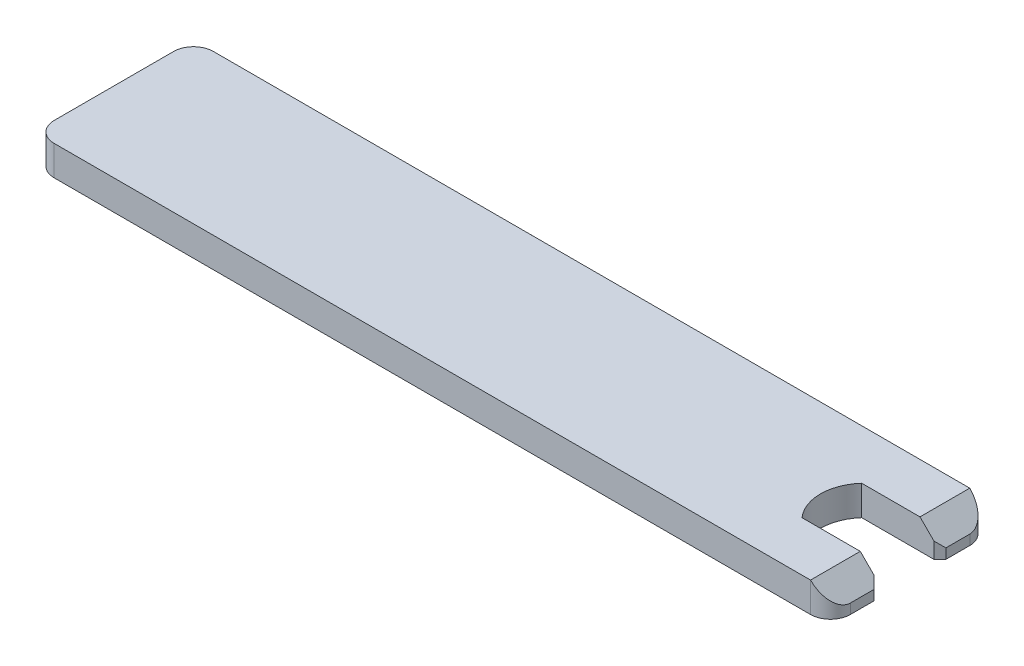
ISO-10303-21;
HEADER;
FILE_DESCRIPTION(('STEP AP214'),'2;1');
FILE_NAME('part.step','',(''),(''),'','','');
FILE_SCHEMA(('AUTOMOTIVE_DESIGN { 1 0 10303 214 1 1 1 1 }'));
ENDSEC;
DATA;
#1=APPLICATION_CONTEXT('core data for automotive mechanical design processes');
#2=APPLICATION_PROTOCOL_DEFINITION('international standard','automotive_design',2000,#1);
#3=PRODUCT_CONTEXT('',#1,'mechanical');
#4=PRODUCT('Part','Part','',(#3));
#5=PRODUCT_RELATED_PRODUCT_CATEGORY('part','',(#4));
#6=PRODUCT_DEFINITION_FORMATION('','',#4);
#7=PRODUCT_DEFINITION_CONTEXT('part definition',#1,'design');
#8=PRODUCT_DEFINITION('design','',#6,#7);
#9=PRODUCT_DEFINITION_SHAPE('','',#8);
#10=(LENGTH_UNIT() NAMED_UNIT(*) SI_UNIT(.MILLI.,.METRE.));
#11=(NAMED_UNIT(*) PLANE_ANGLE_UNIT() SI_UNIT($,.RADIAN.));
#12=(NAMED_UNIT(*) SI_UNIT($,.STERADIAN.) SOLID_ANGLE_UNIT());
#13=UNCERTAINTY_MEASURE_WITH_UNIT(LENGTH_MEASURE(1.E-05),#10,'distance_accuracy_value','');
#14=(GEOMETRIC_REPRESENTATION_CONTEXT(3) GLOBAL_UNCERTAINTY_ASSIGNED_CONTEXT((#13)) GLOBAL_UNIT_ASSIGNED_CONTEXT((#10,
#11,#12)) REPRESENTATION_CONTEXT('',''));
#15=CARTESIAN_POINT('',(0.,0.,0.));
#16=DIRECTION('',(0.,0.,1.));
#17=DIRECTION('',(1.,0.,0.));
#18=AXIS2_PLACEMENT_3D('',#15,#16,#17);
#19=CARTESIAN_POINT('',(2.25,0.75,-1.5));
#20=DIRECTION('',(-1.,0.,0.));
#21=DIRECTION('',(0.,0.,1.));
#22=AXIS2_PLACEMENT_3D('',#19,#20,#21);
#23=PLANE('',#22);
#24=DIRECTION('',(0.,0.,1.));
#25=VECTOR('',#24,1.);
#26=CARTESIAN_POINT('',(2.25,-0.250000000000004,-1.5));
#27=LINE('',#26,#25);
#28=CARTESIAN_POINT('',(2.25,-0.250000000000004,-2.99999999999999));
#29=VERTEX_POINT('',#28);
#30=CARTESIAN_POINT('',(2.25,-0.250000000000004,-1.8));
#31=VERTEX_POINT('',#30);
#32=EDGE_CURVE('E199',#29,#31,#27,.T.);
#33=ORIENTED_EDGE('',*,*,#32,.T.);
#34=DIRECTION('',(0.,-1.,0.));
#35=VECTOR('',#34,1.);
#36=CARTESIAN_POINT('',(2.25,0.75,-1.8));
#37=LINE('',#36,#35);
#38=CARTESIAN_POINT('',(2.25,-0.75,-1.8));
#39=VERTEX_POINT('',#38);
#40=EDGE_CURVE('E246',#31,#39,#37,.T.);
#41=ORIENTED_EDGE('',*,*,#40,.T.);
#42=DIRECTION('',(0.,0.,-1.));
#43=VECTOR('',#42,1.);
#44=CARTESIAN_POINT('',(2.25,-0.75,-1.5));
#45=LINE('',#44,#43);
#46=CARTESIAN_POINT('',(2.25,-0.75,-2.99999999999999));
#47=VERTEX_POINT('',#46);
#48=EDGE_CURVE('E174',#39,#47,#45,.T.);
#49=ORIENTED_EDGE('',*,*,#48,.T.);
#50=DIRECTION('',(0.,-1.,0.));
#51=VECTOR('',#50,1.);
#52=CARTESIAN_POINT('',(2.25,0.75,-2.99999999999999));
#53=LINE('',#52,#51);
#54=EDGE_CURVE('E222',#47,#29,#53,.F.);
#55=ORIENTED_EDGE('',*,*,#54,.T.);
#56=EDGE_LOOP('',(#33,#41,#49,#55));
#57=FACE_BOUND('',#56,.T.);
#58=ADVANCED_FACE('F37',(#57),#23,.F.);
#59=CARTESIAN_POINT('',(2.25,0.75,-3.99999999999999));
#60=DIRECTION('',(0.,0.,1.));
#61=DIRECTION('',(1.,0.,0.));
#62=AXIS2_PLACEMENT_3D('',#59,#60,#61);
#63=PLANE('',#62);
#64=DIRECTION('',(-1.,0.,0.));
#65=VECTOR('',#64,1.);
#66=CARTESIAN_POINT('',(2.25,0.75,-3.99999999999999));
#67=LINE('',#66,#65);
#68=CARTESIAN_POINT('',(1.25,0.75,-3.99999999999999));
#69=VERTEX_POINT('',#68);
#70=CARTESIAN_POINT('',(-36.75,0.75,-4.));
#71=VERTEX_POINT('',#70);
#72=EDGE_CURVE('E193',#69,#71,#67,.T.);
#73=ORIENTED_EDGE('',*,*,#72,.F.);
#74=DIRECTION('',(0.,-1.,0.));
#75=VECTOR('',#74,1.);
#76=CARTESIAN_POINT('',(1.25,0.75,-3.99999999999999));
#77=LINE('',#76,#75);
#78=CARTESIAN_POINT('',(1.25,-0.75,-3.99999999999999));
#79=VERTEX_POINT('',#78);
#80=EDGE_CURVE('E210',#69,#79,#77,.T.);
#81=ORIENTED_EDGE('',*,*,#80,.T.);
#82=DIRECTION('',(-1.,0.,0.));
#83=VECTOR('',#82,1.);
#84=CARTESIAN_POINT('',(2.25,-0.75,-3.99999999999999));
#85=LINE('',#84,#83);
#86=CARTESIAN_POINT('',(-36.75,-0.75,-4.));
#87=VERTEX_POINT('',#86);
#88=EDGE_CURVE('E176',#79,#87,#85,.T.);
#89=ORIENTED_EDGE('',*,*,#88,.T.);
#90=DIRECTION('',(0.,-1.,0.));
#91=VECTOR('',#90,1.);
#92=CARTESIAN_POINT('',(-36.75,0.75,-4.));
#93=LINE('',#92,#91);
#94=EDGE_CURVE('E208',#87,#71,#93,.F.);
#95=ORIENTED_EDGE('',*,*,#94,.T.);
#96=EDGE_LOOP('',(#73,#81,#89,#95));
#97=FACE_BOUND('',#96,.T.);
#98=ADVANCED_FACE('F282',(#97),#63,.F.);
#99=CARTESIAN_POINT('',(-37.75,0.75,-4.));
#100=DIRECTION('',(1.,0.,0.));
#101=DIRECTION('',(0.,0.,-1.));
#102=AXIS2_PLACEMENT_3D('',#99,#100,#101);
#103=PLANE('',#102);
#104=DIRECTION('',(0.,0.,1.));
#105=VECTOR('',#104,1.);
#106=CARTESIAN_POINT('',(-37.75,0.75,-4.));
#107=LINE('',#106,#105);
#108=CARTESIAN_POINT('',(-37.75,0.75,-3.));
#109=VERTEX_POINT('',#108);
#110=CARTESIAN_POINT('',(-37.75,0.75,3.));
#111=VERTEX_POINT('',#110);
#112=EDGE_CURVE('E294',#109,#111,#107,.T.);
#113=ORIENTED_EDGE('',*,*,#112,.F.);
#114=DIRECTION('',(0.,-1.,0.));
#115=VECTOR('',#114,1.);
#116=CARTESIAN_POINT('',(-37.75,0.75,-3.));
#117=LINE('',#116,#115);
#118=CARTESIAN_POINT('',(-37.75,-0.75,-3.));
#119=VERTEX_POINT('',#118);
#120=EDGE_CURVE('E239',#109,#119,#117,.T.);
#121=ORIENTED_EDGE('',*,*,#120,.T.);
#122=DIRECTION('',(0.,0.,1.));
#123=VECTOR('',#122,1.);
#124=CARTESIAN_POINT('',(-37.75,-0.75,-4.));
#125=LINE('',#124,#123);
#126=CARTESIAN_POINT('',(-37.75,-0.75,3.));
#127=VERTEX_POINT('',#126);
#128=EDGE_CURVE('E179',#119,#127,#125,.T.);
#129=ORIENTED_EDGE('',*,*,#128,.T.);
#130=DIRECTION('',(0.,-1.,0.));
#131=VECTOR('',#130,1.);
#132=CARTESIAN_POINT('',(-37.75,0.75,3.));
#133=LINE('',#132,#131);
#134=EDGE_CURVE('E237',#127,#111,#133,.F.);
#135=ORIENTED_EDGE('',*,*,#134,.T.);
#136=EDGE_LOOP('',(#113,#121,#129,#135));
#137=FACE_BOUND('',#136,.T.);
#138=ADVANCED_FACE('F291',(#137),#103,.F.);
#139=CARTESIAN_POINT('',(2.25,0.75,3.99999999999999));
#140=DIRECTION('',(0.,0.,-1.));
#141=DIRECTION('',(-1.,0.,0.));
#142=AXIS2_PLACEMENT_3D('',#139,#140,#141);
#143=PLANE('',#142);
#144=DIRECTION('',(1.,0.,0.));
#145=VECTOR('',#144,1.);
#146=CARTESIAN_POINT('',(2.25,-0.75,3.99999999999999));
#147=LINE('',#146,#145);
#148=CARTESIAN_POINT('',(-36.75,-0.75,4.));
#149=VERTEX_POINT('',#148);
#150=CARTESIAN_POINT('',(1.25,-0.75,3.99999999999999));
#151=VERTEX_POINT('',#150);
#152=EDGE_CURVE('E182',#149,#151,#147,.T.);
#153=ORIENTED_EDGE('',*,*,#152,.T.);
#154=DIRECTION('',(0.,-1.,0.));
#155=VECTOR('',#154,1.);
#156=CARTESIAN_POINT('',(1.25,0.75,3.99999999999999));
#157=LINE('',#156,#155);
#158=CARTESIAN_POINT('',(1.25,0.75,3.99999999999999));
#159=VERTEX_POINT('',#158);
#160=EDGE_CURVE('E232',#151,#159,#157,.F.);
#161=ORIENTED_EDGE('',*,*,#160,.T.);
#162=DIRECTION('',(1.,0.,0.));
#163=VECTOR('',#162,1.);
#164=CARTESIAN_POINT('',(2.25,0.75,3.99999999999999));
#165=LINE('',#164,#163);
#166=CARTESIAN_POINT('',(-36.75,0.75,4.));
#167=VERTEX_POINT('',#166);
#168=EDGE_CURVE('E154',#167,#159,#165,.T.);
#169=ORIENTED_EDGE('',*,*,#168,.F.);
#170=DIRECTION('',(0.,-1.,0.));
#171=VECTOR('',#170,1.);
#172=CARTESIAN_POINT('',(-36.75,0.75,4.));
#173=LINE('',#172,#171);
#174=EDGE_CURVE('E229',#167,#149,#173,.T.);
#175=ORIENTED_EDGE('',*,*,#174,.T.);
#176=EDGE_LOOP('',(#153,#161,#169,#175));
#177=FACE_BOUND('',#176,.T.);
#178=ADVANCED_FACE('F309',(#177),#143,.F.);
#179=CARTESIAN_POINT('',(2.25,0.75,1.5));
#180=DIRECTION('',(-1.,0.,0.));
#181=DIRECTION('',(0.,0.,1.));
#182=AXIS2_PLACEMENT_3D('',#179,#180,#181);
#183=PLANE('',#182);
#184=DIRECTION('',(0.,0.,-1.));
#185=VECTOR('',#184,1.);
#186=CARTESIAN_POINT('',(2.25,-0.75,1.5));
#187=LINE('',#186,#185);
#188=CARTESIAN_POINT('',(2.25,-0.75,2.99999999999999));
#189=VERTEX_POINT('',#188);
#190=CARTESIAN_POINT('',(2.25,-0.75,1.8));
#191=VERTEX_POINT('',#190);
#192=EDGE_CURVE('E185',#189,#191,#187,.T.);
#193=ORIENTED_EDGE('',*,*,#192,.T.);
#194=DIRECTION('',(0.,1.,0.));
#195=VECTOR('',#194,1.);
#196=CARTESIAN_POINT('',(2.25,0.75,1.8));
#197=LINE('',#196,#195);
#198=CARTESIAN_POINT('',(2.25,-0.250000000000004,1.8));
#199=VERTEX_POINT('',#198);
#200=EDGE_CURVE('E45',#191,#199,#197,.T.);
#201=ORIENTED_EDGE('',*,*,#200,.T.);
#202=DIRECTION('',(0.,0.,1.));
#203=VECTOR('',#202,1.);
#204=CARTESIAN_POINT('',(2.25,-0.250000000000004,3.99999999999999));
#205=LINE('',#204,#203);
#206=CARTESIAN_POINT('',(2.25,-0.250000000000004,2.99999999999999));
#207=VERTEX_POINT('',#206);
#208=EDGE_CURVE('E206',#199,#207,#205,.T.);
#209=ORIENTED_EDGE('',*,*,#208,.T.);
#210=DIRECTION('',(0.,-1.,0.));
#211=VECTOR('',#210,1.);
#212=CARTESIAN_POINT('',(2.25,0.75,2.99999999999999));
#213=LINE('',#212,#211);
#214=EDGE_CURVE('E226',#207,#189,#213,.T.);
#215=ORIENTED_EDGE('',*,*,#214,.T.);
#216=EDGE_LOOP('',(#193,#201,#209,#215));
#217=FACE_BOUND('',#216,.T.);
#218=ADVANCED_FACE('F307',(#217),#183,.F.);
#219=CARTESIAN_POINT('',(-1.67705098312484,0.75,1.5));
#220=DIRECTION('',(0.,0.,1.));
#221=DIRECTION('',(1.,0.,0.));
#222=AXIS2_PLACEMENT_3D('',#219,#220,#221);
#223=PLANE('',#222);
#224=DIRECTION('',(0.707106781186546,-0.707106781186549,0.));
#225=VECTOR('',#224,1.);
#226=CARTESIAN_POINT('',(1.25,0.75,1.5));
#227=LINE('',#226,#225);
#228=CARTESIAN_POINT('',(1.25,0.75,1.5));
#229=VERTEX_POINT('',#228);
#230=CARTESIAN_POINT('',(1.95,0.0499999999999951,1.5));
#231=VERTEX_POINT('',#230);
#232=EDGE_CURVE('E204',#229,#231,#227,.T.);
#233=ORIENTED_EDGE('',*,*,#232,.T.);
#234=DIRECTION('',(0.,-1.,0.));
#235=VECTOR('',#234,1.);
#236=CARTESIAN_POINT('',(1.95,0.75,1.5));
#237=LINE('',#236,#235);
#238=CARTESIAN_POINT('',(1.95,-0.75,1.5));
#239=VERTEX_POINT('',#238);
#240=EDGE_CURVE('E257',#231,#239,#237,.T.);
#241=ORIENTED_EDGE('',*,*,#240,.T.);
#242=DIRECTION('',(-1.,0.,0.));
#243=VECTOR('',#242,1.);
#244=CARTESIAN_POINT('',(-1.67705098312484,-0.75,1.5));
#245=LINE('',#244,#243);
#246=CARTESIAN_POINT('',(-1.67705098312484,-0.75,1.5));
#247=VERTEX_POINT('',#246);
#248=EDGE_CURVE('E161',#239,#247,#245,.T.);
#249=ORIENTED_EDGE('',*,*,#248,.T.);
#250=DIRECTION('',(0.,-1.,0.));
#251=VECTOR('',#250,1.);
#252=CARTESIAN_POINT('',(-1.67705098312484,0.75,1.5));
#253=LINE('',#252,#251);
#254=CARTESIAN_POINT('',(-1.67705098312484,0.75,1.5));
#255=VERTEX_POINT('',#254);
#256=EDGE_CURVE('E157',#255,#247,#253,.T.);
#257=ORIENTED_EDGE('',*,*,#256,.F.);
#258=DIRECTION('',(-1.,0.,0.));
#259=VECTOR('',#258,1.);
#260=CARTESIAN_POINT('',(-1.67705098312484,0.75,1.5));
#261=LINE('',#260,#259);
#262=EDGE_CURVE('E142',#229,#255,#261,.T.);
#263=ORIENTED_EDGE('',*,*,#262,.F.);
#264=EDGE_LOOP('',(#233,#241,#249,#257,#263));
#265=FACE_BOUND('',#264,.T.);
#266=ADVANCED_FACE('F158',(#265),#223,.F.);
#267=CARTESIAN_POINT('',(0.,0.75,0.));
#268=DIRECTION('',(0.,-1.,0.));
#269=DIRECTION('',(0.,0.,-1.));
#270=AXIS2_PLACEMENT_3D('',#267,#268,#269);
#271=CYLINDRICAL_SURFACE('',#270,2.25);
#272=CARTESIAN_POINT('',(0.,-0.75,0.));
#273=DIRECTION('',(0.,-1.,0.));
#274=DIRECTION('',(0.,0.,1.));
#275=AXIS2_PLACEMENT_3D('',#272,#273,#274);
#276=CIRCLE('',#275,2.25);
#277=CARTESIAN_POINT('',(-1.67705098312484,-0.75,-1.5));
#278=VERTEX_POINT('',#277);
#279=EDGE_CURVE('E188',#247,#278,#276,.T.);
#280=ORIENTED_EDGE('',*,*,#279,.T.);
#281=DIRECTION('',(0.,-1.,0.));
#282=VECTOR('',#281,1.);
#283=CARTESIAN_POINT('',(-1.67705098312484,0.75,-1.5));
#284=LINE('',#283,#282);
#285=CARTESIAN_POINT('',(-1.67705098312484,0.75,-1.5));
#286=VERTEX_POINT('',#285);
#287=EDGE_CURVE('E164',#286,#278,#284,.T.);
#288=ORIENTED_EDGE('',*,*,#287,.F.);
#289=CARTESIAN_POINT('',(0.,0.75,0.));
#290=DIRECTION('',(0.,-1.,0.));
#291=DIRECTION('',(0.,0.,1.));
#292=AXIS2_PLACEMENT_3D('',#289,#290,#291);
#293=CIRCLE('',#292,2.25);
#294=EDGE_CURVE('E148',#255,#286,#293,.T.);
#295=ORIENTED_EDGE('',*,*,#294,.F.);
#296=ORIENTED_EDGE('',*,*,#256,.T.);
#297=EDGE_LOOP('',(#280,#288,#295,#296));
#298=FACE_BOUND('',#297,.T.);
#299=ADVANCED_FACE('F166',(#298),#271,.F.);
#300=CARTESIAN_POINT('',(-1.67705098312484,0.75,-1.5));
#301=DIRECTION('',(0.,0.,-1.));
#302=DIRECTION('',(-1.,0.,0.));
#303=AXIS2_PLACEMENT_3D('',#300,#301,#302);
#304=PLANE('',#303);
#305=DIRECTION('',(1.,0.,0.));
#306=VECTOR('',#305,1.);
#307=CARTESIAN_POINT('',(-1.67705098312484,-0.75,-1.5));
#308=LINE('',#307,#306);
#309=CARTESIAN_POINT('',(1.95,-0.75,-1.5));
#310=VERTEX_POINT('',#309);
#311=EDGE_CURVE('E190',#278,#310,#308,.T.);
#312=ORIENTED_EDGE('',*,*,#311,.T.);
#313=DIRECTION('',(0.,1.,0.));
#314=VECTOR('',#313,1.);
#315=CARTESIAN_POINT('',(1.95,0.75,-1.5));
#316=LINE('',#315,#314);
#317=CARTESIAN_POINT('',(1.95,0.0499999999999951,-1.5));
#318=VERTEX_POINT('',#317);
#319=EDGE_CURVE('E253',#310,#318,#316,.T.);
#320=ORIENTED_EDGE('',*,*,#319,.T.);
#321=DIRECTION('',(-0.707106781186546,0.707106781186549,0.));
#322=VECTOR('',#321,1.);
#323=CARTESIAN_POINT('',(1.25,0.75,-1.5));
#324=LINE('',#323,#322);
#325=CARTESIAN_POINT('',(1.25,0.75,-1.5));
#326=VERTEX_POINT('',#325);
#327=EDGE_CURVE('E202',#318,#326,#324,.T.);
#328=ORIENTED_EDGE('',*,*,#327,.T.);
#329=DIRECTION('',(1.,0.,0.));
#330=VECTOR('',#329,1.);
#331=CARTESIAN_POINT('',(-1.67705098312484,0.75,-1.5));
#332=LINE('',#331,#330);
#333=EDGE_CURVE('E169',#286,#326,#332,.T.);
#334=ORIENTED_EDGE('',*,*,#333,.F.);
#335=ORIENTED_EDGE('',*,*,#287,.T.);
#336=EDGE_LOOP('',(#312,#320,#328,#334,#335));
#337=FACE_BOUND('',#336,.T.);
#338=ADVANCED_FACE('F266',(#337),#304,.F.);
#339=CARTESIAN_POINT('',(0.,0.75,0.));
#340=DIRECTION('',(0.,1.,0.));
#341=DIRECTION('',(0.,0.,1.));
#342=AXIS2_PLACEMENT_3D('',#339,#340,#341);
#343=PLANE('',#342);
#344=ORIENTED_EDGE('',*,*,#72,.T.);
#345=CARTESIAN_POINT('',(-36.75,0.75,-3.));
#346=DIRECTION('',(0.,1.,0.));
#347=DIRECTION('',(0.,0.,1.));
#348=AXIS2_PLACEMENT_3D('',#345,#346,#347);
#349=CIRCLE('',#348,1.);
#350=EDGE_CURVE('E244',#71,#109,#349,.T.);
#351=ORIENTED_EDGE('',*,*,#350,.T.);
#352=ORIENTED_EDGE('',*,*,#112,.T.);
#353=CARTESIAN_POINT('',(-36.75,0.75,3.));
#354=DIRECTION('',(0.,1.,0.));
#355=DIRECTION('',(0.,0.,1.));
#356=AXIS2_PLACEMENT_3D('',#353,#354,#355);
#357=CIRCLE('',#356,1.);
#358=EDGE_CURVE('E242',#111,#167,#357,.T.);
#359=ORIENTED_EDGE('',*,*,#358,.T.);
#360=ORIENTED_EDGE('',*,*,#168,.T.);
#361=DIRECTION('',(0.,0.,-1.));
#362=VECTOR('',#361,1.);
#363=CARTESIAN_POINT('',(1.25,0.75,1.5));
#364=LINE('',#363,#362);
#365=EDGE_CURVE('E152',#159,#229,#364,.T.);
#366=ORIENTED_EDGE('',*,*,#365,.T.);
#367=ORIENTED_EDGE('',*,*,#262,.T.);
#368=ORIENTED_EDGE('',*,*,#294,.T.);
#369=ORIENTED_EDGE('',*,*,#333,.T.);
#370=DIRECTION('',(0.,0.,-1.));
#371=VECTOR('',#370,1.);
#372=CARTESIAN_POINT('',(1.25,0.75,-3.99999999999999));
#373=LINE('',#372,#371);
#374=EDGE_CURVE('E196',#326,#69,#373,.T.);
#375=ORIENTED_EDGE('',*,*,#374,.T.);
#376=EDGE_LOOP('',(#344,#351,#352,#359,#360,#366,#367,#368,#369,#375));
#377=FACE_BOUND('',#376,.T.);
#378=ADVANCED_FACE('F145',(#377),#343,.T.);
#379=CARTESIAN_POINT('',(0.,-0.75,0.));
#380=DIRECTION('',(0.,1.,0.));
#381=DIRECTION('',(0.,0.,1.));
#382=AXIS2_PLACEMENT_3D('',#379,#380,#381);
#383=PLANE('',#382);
#384=ORIENTED_EDGE('',*,*,#48,.F.);
#385=DIRECTION('',(0.707106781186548,0.,-0.707106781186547));
#386=VECTOR('',#385,1.);
#387=CARTESIAN_POINT('',(2.25,-0.75,-1.8));
#388=LINE('',#387,#386);
#389=EDGE_CURVE('E251',#39,#310,#388,.F.);
#390=ORIENTED_EDGE('',*,*,#389,.T.);
#391=ORIENTED_EDGE('',*,*,#311,.F.);
#392=ORIENTED_EDGE('',*,*,#279,.F.);
#393=ORIENTED_EDGE('',*,*,#248,.F.);
#394=DIRECTION('',(-0.707106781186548,0.,-0.707106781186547));
#395=VECTOR('',#394,1.);
#396=CARTESIAN_POINT('',(1.95,-0.75,1.5));
#397=LINE('',#396,#395);
#398=EDGE_CURVE('E249',#239,#191,#397,.F.);
#399=ORIENTED_EDGE('',*,*,#398,.T.);
#400=ORIENTED_EDGE('',*,*,#192,.F.);
#401=CARTESIAN_POINT('',(1.25,-0.75,2.99999999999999));
#402=DIRECTION('',(0.,1.,0.));
#403=DIRECTION('',(0.,0.,1.));
#404=AXIS2_PLACEMENT_3D('',#401,#402,#403);
#405=CIRCLE('',#404,1.);
#406=EDGE_CURVE('E217',#189,#151,#405,.F.);
#407=ORIENTED_EDGE('',*,*,#406,.T.);
#408=ORIENTED_EDGE('',*,*,#152,.F.);
#409=CARTESIAN_POINT('',(-36.75,-0.75,3.));
#410=DIRECTION('',(0.,1.,0.));
#411=DIRECTION('',(0.,0.,1.));
#412=AXIS2_PLACEMENT_3D('',#409,#410,#411);
#413=CIRCLE('',#412,1.);
#414=EDGE_CURVE('E213',#149,#127,#413,.F.);
#415=ORIENTED_EDGE('',*,*,#414,.T.);
#416=ORIENTED_EDGE('',*,*,#128,.F.);
#417=CARTESIAN_POINT('',(-36.75,-0.75,-3.));
#418=DIRECTION('',(0.,1.,0.));
#419=DIRECTION('',(0.,0.,1.));
#420=AXIS2_PLACEMENT_3D('',#417,#418,#419);
#421=CIRCLE('',#420,1.);
#422=EDGE_CURVE('E215',#119,#87,#421,.F.);
#423=ORIENTED_EDGE('',*,*,#422,.T.);
#424=ORIENTED_EDGE('',*,*,#88,.F.);
#425=CARTESIAN_POINT('',(1.25,-0.75,-2.99999999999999));
#426=DIRECTION('',(0.,1.,0.));
#427=DIRECTION('',(0.,0.,1.));
#428=AXIS2_PLACEMENT_3D('',#425,#426,#427);
#429=CIRCLE('',#428,1.);
#430=EDGE_CURVE('E219',#79,#47,#429,.F.);
#431=ORIENTED_EDGE('',*,*,#430,.T.);
#432=EDGE_LOOP('',(#384,#390,#391,#392,#393,#399,#400,#407,#408,#415,#416,#423,#424,#431));
#433=FACE_BOUND('',#432,.T.);
#434=ADVANCED_FACE('F262',(#433),#383,.F.);
#435=CARTESIAN_POINT('',(1.25,0.75,0.));
#436=DIRECTION('',(0.707106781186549,0.707106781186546,0.));
#437=DIRECTION('',(0.,0.,1.));
#438=AXIS2_PLACEMENT_3D('',#435,#436,#437);
#439=PLANE('',#438);
#440=ORIENTED_EDGE('',*,*,#327,.F.);
#441=DIRECTION('',(-0.577350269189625,0.577350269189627,0.577350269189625));
#442=VECTOR('',#441,1.);
#443=CARTESIAN_POINT('',(0.983333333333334,1.01666666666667,-0.533333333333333));
#444=LINE('',#443,#442);
#445=EDGE_CURVE('E255',#318,#31,#444,.F.);
#446=ORIENTED_EDGE('',*,*,#445,.T.);
#447=ORIENTED_EDGE('',*,*,#32,.F.);
#448=CARTESIAN_POINT('',(1.25,0.749999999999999,-2.99999999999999));
#449=DIRECTION('',(0.707106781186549,0.707106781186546,0.));
#450=DIRECTION('',(0.707106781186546,-0.707106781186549,0.));
#451=AXIS2_PLACEMENT_3D('',#448,#449,#450);
#452=ELLIPSE('',#451,1.4142135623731,1.);
#453=EDGE_CURVE('E224',#29,#69,#452,.T.);
#454=ORIENTED_EDGE('',*,*,#453,.T.);
#455=ORIENTED_EDGE('',*,*,#374,.F.);
#456=EDGE_LOOP('',(#440,#446,#447,#454,#455));
#457=FACE_BOUND('',#456,.T.);
#458=ADVANCED_FACE('F272',(#457),#439,.T.);
#459=CARTESIAN_POINT('',(1.25,0.75,0.));
#460=DIRECTION('',(0.707106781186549,0.707106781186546,0.));
#461=DIRECTION('',(0.,0.,1.));
#462=AXIS2_PLACEMENT_3D('',#459,#460,#461);
#463=PLANE('',#462);
#464=ORIENTED_EDGE('',*,*,#208,.F.);
#465=DIRECTION('',(0.577350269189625,-0.577350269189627,0.577350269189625));
#466=VECTOR('',#465,1.);
#467=CARTESIAN_POINT('',(0.983333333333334,1.01666666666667,0.533333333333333));
#468=LINE('',#467,#466);
#469=EDGE_CURVE('E11',#199,#231,#468,.F.);
#470=ORIENTED_EDGE('',*,*,#469,.T.);
#471=ORIENTED_EDGE('',*,*,#232,.F.);
#472=ORIENTED_EDGE('',*,*,#365,.F.);
#473=CARTESIAN_POINT('',(1.25,0.749999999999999,2.99999999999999));
#474=DIRECTION('',(0.707106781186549,0.707106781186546,0.));
#475=DIRECTION('',(0.707106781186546,-0.707106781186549,0.));
#476=AXIS2_PLACEMENT_3D('',#473,#474,#475);
#477=ELLIPSE('',#476,1.4142135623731,1.);
#478=EDGE_CURVE('E234',#159,#207,#477,.T.);
#479=ORIENTED_EDGE('',*,*,#478,.T.);
#480=EDGE_LOOP('',(#464,#470,#471,#472,#479));
#481=FACE_BOUND('',#480,.T.);
#482=ADVANCED_FACE('F302',(#481),#463,.T.);
#483=CARTESIAN_POINT('',(1.25,0.75,-2.99999999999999));
#484=DIRECTION('',(0.,-1.,0.));
#485=DIRECTION('',(0.,0.,-1.));
#486=AXIS2_PLACEMENT_3D('',#483,#484,#485);
#487=CYLINDRICAL_SURFACE('',#486,1.);
#488=ORIENTED_EDGE('',*,*,#453,.F.);
#489=ORIENTED_EDGE('',*,*,#54,.F.);
#490=ORIENTED_EDGE('',*,*,#430,.F.);
#491=ORIENTED_EDGE('',*,*,#80,.F.);
#492=EDGE_LOOP('',(#488,#489,#490,#491));
#493=FACE_BOUND('',#492,.T.);
#494=ADVANCED_FACE('F279',(#493),#487,.T.);
#495=CARTESIAN_POINT('',(1.25,0.75,2.99999999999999));
#496=DIRECTION('',(0.,-1.,0.));
#497=DIRECTION('',(0.,0.,-1.));
#498=AXIS2_PLACEMENT_3D('',#495,#496,#497);
#499=CYLINDRICAL_SURFACE('',#498,1.);
#500=ORIENTED_EDGE('',*,*,#478,.F.);
#501=ORIENTED_EDGE('',*,*,#160,.F.);
#502=ORIENTED_EDGE('',*,*,#406,.F.);
#503=ORIENTED_EDGE('',*,*,#214,.F.);
#504=EDGE_LOOP('',(#500,#501,#502,#503));
#505=FACE_BOUND('',#504,.T.);
#506=ADVANCED_FACE('F306',(#505),#499,.T.);
#507=CARTESIAN_POINT('',(-36.75,0.75,-3.));
#508=DIRECTION('',(0.,-1.,0.));
#509=DIRECTION('',(0.,0.,-1.));
#510=AXIS2_PLACEMENT_3D('',#507,#508,#509);
#511=CYLINDRICAL_SURFACE('',#510,1.);
#512=ORIENTED_EDGE('',*,*,#350,.F.);
#513=ORIENTED_EDGE('',*,*,#94,.F.);
#514=ORIENTED_EDGE('',*,*,#422,.F.);
#515=ORIENTED_EDGE('',*,*,#120,.F.);
#516=EDGE_LOOP('',(#512,#513,#514,#515));
#517=FACE_BOUND('',#516,.T.);
#518=ADVANCED_FACE('F288',(#517),#511,.T.);
#519=CARTESIAN_POINT('',(-36.75,0.75,3.));
#520=DIRECTION('',(0.,-1.,0.));
#521=DIRECTION('',(0.,0.,-1.));
#522=AXIS2_PLACEMENT_3D('',#519,#520,#521);
#523=CYLINDRICAL_SURFACE('',#522,1.);
#524=ORIENTED_EDGE('',*,*,#358,.F.);
#525=ORIENTED_EDGE('',*,*,#134,.F.);
#526=ORIENTED_EDGE('',*,*,#414,.F.);
#527=ORIENTED_EDGE('',*,*,#174,.F.);
#528=EDGE_LOOP('',(#524,#525,#526,#527));
#529=FACE_BOUND('',#528,.T.);
#530=ADVANCED_FACE('F311',(#529),#523,.T.);
#531=CARTESIAN_POINT('',(2.25,0.75,-1.8));
#532=DIRECTION('',(-0.707106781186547,0.,-0.707106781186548));
#533=DIRECTION('',(0.,-1.,0.));
#534=AXIS2_PLACEMENT_3D('',#531,#532,#533);
#535=PLANE('',#534);
#536=ORIENTED_EDGE('',*,*,#445,.F.);
#537=ORIENTED_EDGE('',*,*,#319,.F.);
#538=ORIENTED_EDGE('',*,*,#389,.F.);
#539=ORIENTED_EDGE('',*,*,#40,.F.);
#540=EDGE_LOOP('',(#536,#537,#538,#539));
#541=FACE_BOUND('',#540,.T.);
#542=ADVANCED_FACE('F313',(#541),#535,.F.);
#543=CARTESIAN_POINT('',(1.95,0.75,1.5));
#544=DIRECTION('',(-0.707106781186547,0.,0.707106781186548));
#545=DIRECTION('',(0.,-1.,0.));
#546=AXIS2_PLACEMENT_3D('',#543,#544,#545);
#547=PLANE('',#546);
#548=ORIENTED_EDGE('',*,*,#469,.F.);
#549=ORIENTED_EDGE('',*,*,#200,.F.);
#550=ORIENTED_EDGE('',*,*,#398,.F.);
#551=ORIENTED_EDGE('',*,*,#240,.F.);
#552=EDGE_LOOP('',(#548,#549,#550,#551));
#553=FACE_BOUND('',#552,.T.);
#554=ADVANCED_FACE('F39',(#553),#547,.F.);
#555=CLOSED_SHELL('',(#58,#98,#138,#178,#218,#266,#299,#338,#378,#434,#458,#482,#494,#506,#518,
#530,#542,#554));
#556=MANIFOLD_SOLID_BREP('B2',#555);
#557=ADVANCED_BREP_SHAPE_REPRESENTATION('',(#18,#556),#14);
#558=SHAPE_DEFINITION_REPRESENTATION(#9,#557);
ENDSEC;
END-ISO-10303-21;
